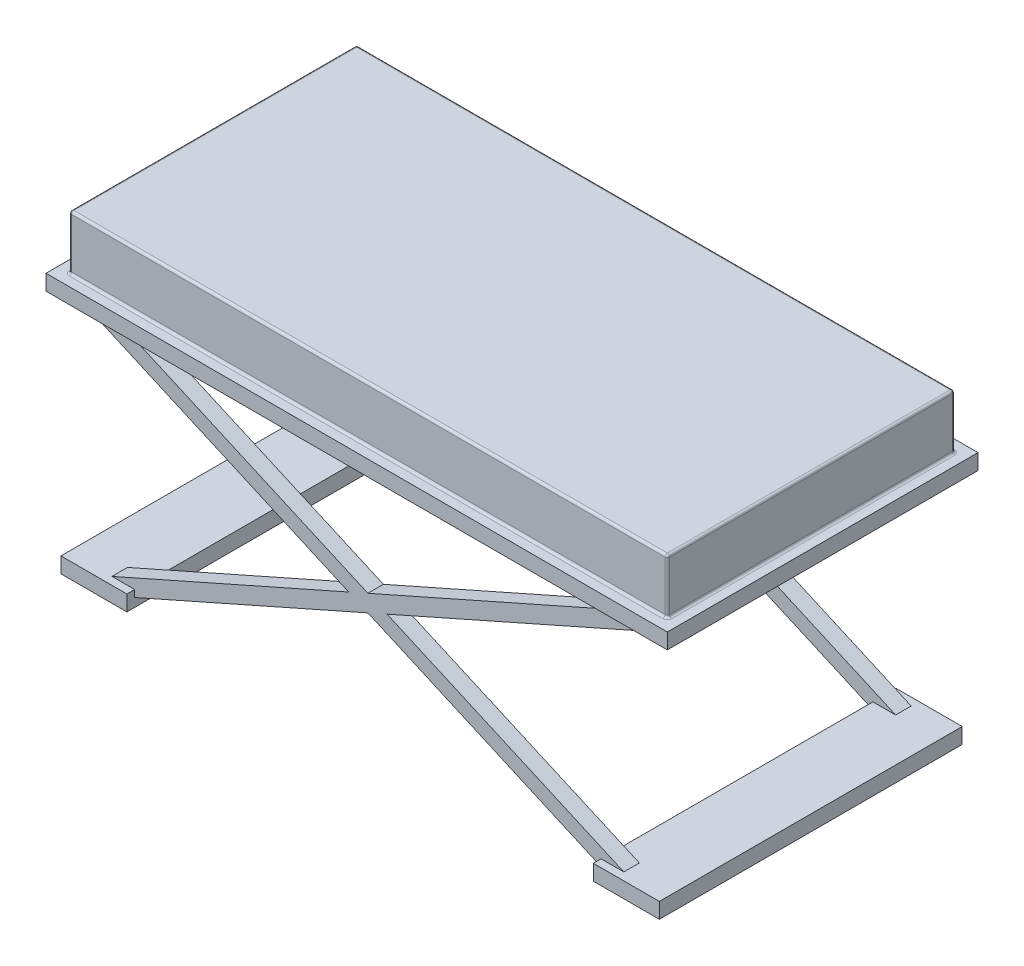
from build123d import *

# Parameters (mm, degrees)
SKETCH1_W                = 2032
SKETCH1_H                = 1016
SKETCH1_W_2              = 1955.8
SKETCH1_H_2              = 939.8
BOSS_EXTRUDE1_DEPTH      = 50.8
SKETCH1_3_W              = 1955.8
SKETCH1_3_H              = 939.8
BOSS_EXTRUDE2_DEPTH      = 228.6
FILLET1_R                = 7.62
BOSS_EXTRUDE3_START      = 304.8
BOSS_EXTRUDE3_DEPTH      = 50.8
BOSS_EXTRUDE4_START      = -584.2
BOSS_EXTRUDE4_DEPTH      = 50.8
BOSS_EXTRUDE5_DEPTH      = 381
BOSS_EXTRUDE5_DEPTH_BACK = 609.6
SKETCH2_5_W              = 215.9
SKETCH2_5_H              = 50.8


with BuildPart() as part:
    # Sketch1 → Boss-Extrude1 (new body)
    # profile 1 of 2: a face of its own
    with BuildSketch(Plane(origin=(0, 0, 0), x_dir=(1, 0, 0), z_dir=(0, 1, 0))):
        with Locations((159.867494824, 115.693581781)):
            Rectangle(SKETCH1_W, SKETCH1_H)
        with Locations((159.867494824, 115.693581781)):
            Rectangle(SKETCH1_W_2, SKETCH1_H_2, mode=Mode.SUBTRACT)
    # profile 2 of 2: a face of its own
    with BuildSketch(Plane(origin=(0, 0, 0), x_dir=(1, 0, 0), z_dir=(0, 1, 0))):
        with Locations((159.867494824, 115.693581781)):
            Rectangle(SKETCH1_W_2, SKETCH1_H_2)
    extrude(amount=BOSS_EXTRUDE1_DEPTH)

    # Sketch1_3 → Boss-Extrude2 (add)
    with BuildSketch(Plane(origin=(0, 0, 0), x_dir=(1, 0, 0), z_dir=(0, 1, 0))):
        with Locations((159.867494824, 115.693581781)):
            Rectangle(SKETCH1_3_W, SKETCH1_3_H)
    extrude(amount=BOSS_EXTRUDE2_DEPTH)

    # Fillet1
    fillet1_edges = [part.edges().sort_by_distance(p)[0] for p in [
        (159.867494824, 50.8, 354.206418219),
        (1137.767494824, 50.8, -115.693581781),
        (-818.032505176, 139.7, -585.593581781),
        (-818.032505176, 50.8, -115.693581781),
        (-818.032505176, 228.6, -115.693581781),
        (-818.032505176, 139.7, 354.206418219),
        (1137.767494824, 139.7, 354.206418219),
        (1137.767494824, 139.7, -585.593581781),
        (159.867494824, 50.8, -585.593581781),
        (159.867494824, 228.6, -585.593581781),
        (159.867494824, 228.6, 354.206418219),
        (1137.767494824, 228.6, -115.693581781),
    ]]
    fillet(fillet1_edges, radius=FILLET1_R)

    # Sketch2 → Boss-Extrude3 (add)
    with BuildSketch(Plane.XY.offset(BOSS_EXTRUDE3_START)):
        Polygon((-666.405018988, 0), (-791.859991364, 0), (97.140008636, -393.7), (-677.150313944, -736.6), (-602.780883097, -736.6), (-602.780883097, -759.223596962), (159.867494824, -421.479315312), (922.515872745, -759.223596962), (922.515872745, -736.6), (996.885303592, -736.6), (222.594981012, -393.7), (1111.594981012, 0), (986.140008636, 0), (159.867494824, -365.920684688), align=None)
    extrude(amount=BOSS_EXTRUDE3_DEPTH)

    # Sketch2_4 → Boss-Extrude4 (add)
    with BuildSketch(Plane.XY.offset(BOSS_EXTRUDE4_START)):
        Polygon((-666.405018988, 0), (-791.859991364, 0), (97.140008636, -393.7), (-677.150313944, -736.6), (-602.780883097, -736.6), (-602.780883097, -759.223596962), (159.867494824, -421.479315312), (922.515872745, -759.223596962), (922.515872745, -736.6), (996.885303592, -736.6), (222.594981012, -393.7), (1111.594981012, 0), (986.140008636, 0), (159.867494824, -365.920684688), align=None)
    extrude(amount=BOSS_EXTRUDE4_DEPTH)

    # Sketch2_5 → Boss-Extrude5 (add, two sides: drawn at the far end of the back side and taken through both)
    with BuildSketch(Plane.XY.offset(-BOSS_EXTRUDE5_DEPTH_BACK)):
        with Locations((-710.730883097, -762)):
            Rectangle(SKETCH2_5_W, SKETCH2_5_H)
        with Locations((1030.465872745, -762)):
            Rectangle(SKETCH2_5_W, SKETCH2_5_H)
    extrude(amount=BOSS_EXTRUDE5_DEPTH + BOSS_EXTRUDE5_DEPTH_BACK)


solid = part.part
